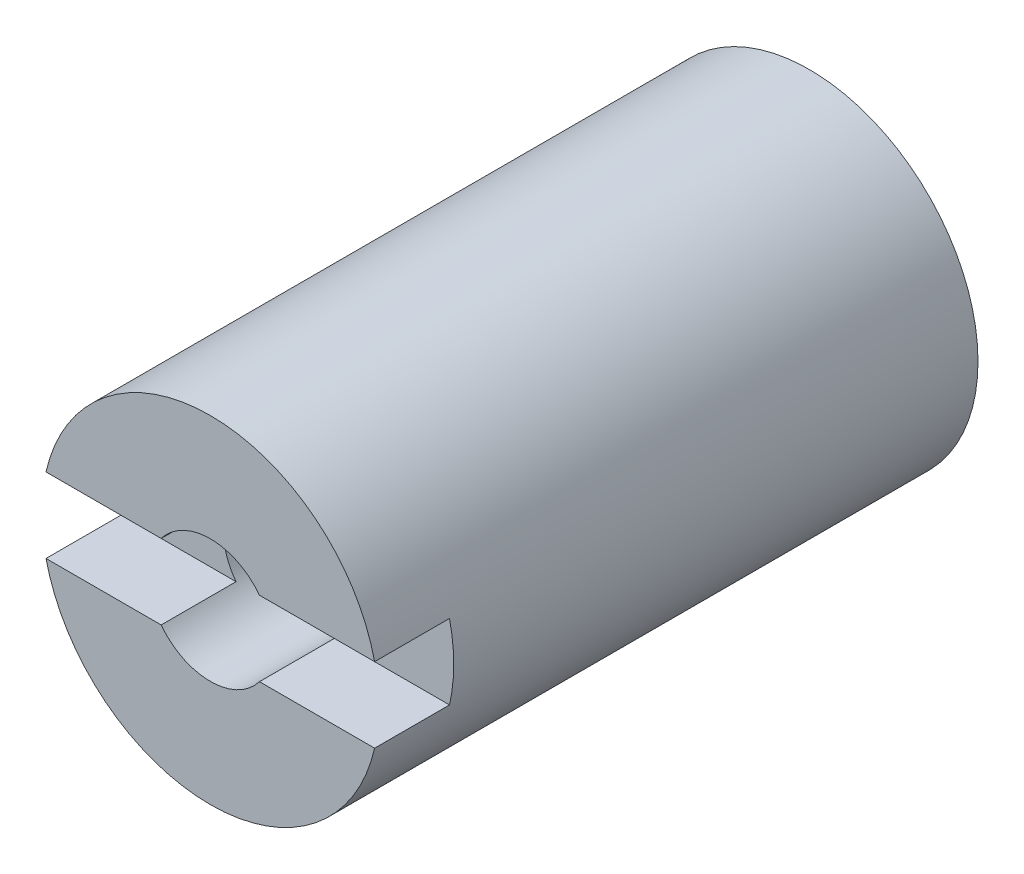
from build123d import *

# Parameters (mm, degrees)
ESQUISSE1_R             = 4.5
BASE_EXTRUSION_DEPTH    = 16
M4X0_7_TROU_TARAUD_1_D  = 3.3
ENL_V_MAT_EXTRU_1_DEPTH = 2


with BuildPart() as part:
    # Esquisse1 → Base-Extrusion (new body)
    with BuildSketch(Plane.XY):
        Circle(ESQUISSE1_R)
    extrude(amount=-BASE_EXTRUSION_DEPTH)

    # M4x0.7 Trou taraud_1 (through all)
    with Locations(Plane.XY):
        with Locations((0, 0)):
            Hole(M4X0_7_TROU_TARAUD_1_D / 2)

    # Esquisse4 → Enl_v. mat.-Extru.1 (cut)
    with BuildSketch(Plane.XY):
        with BuildLine():
            Line((-4.387482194, 1), (4.387482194, 1))
            ThreePointArc((4.387482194, 1), (4.5, 0), (4.387482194, -1))
            Line((4.387482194, -1), (-4.387482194, -1))
            ThreePointArc((-4.387482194, -1), (-4.5, 0), (-4.387482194, 1))
        make_face()
    extrude(amount=-ENL_V_MAT_EXTRU_1_DEPTH, mode=Mode.SUBTRACT)


solid = part.part
